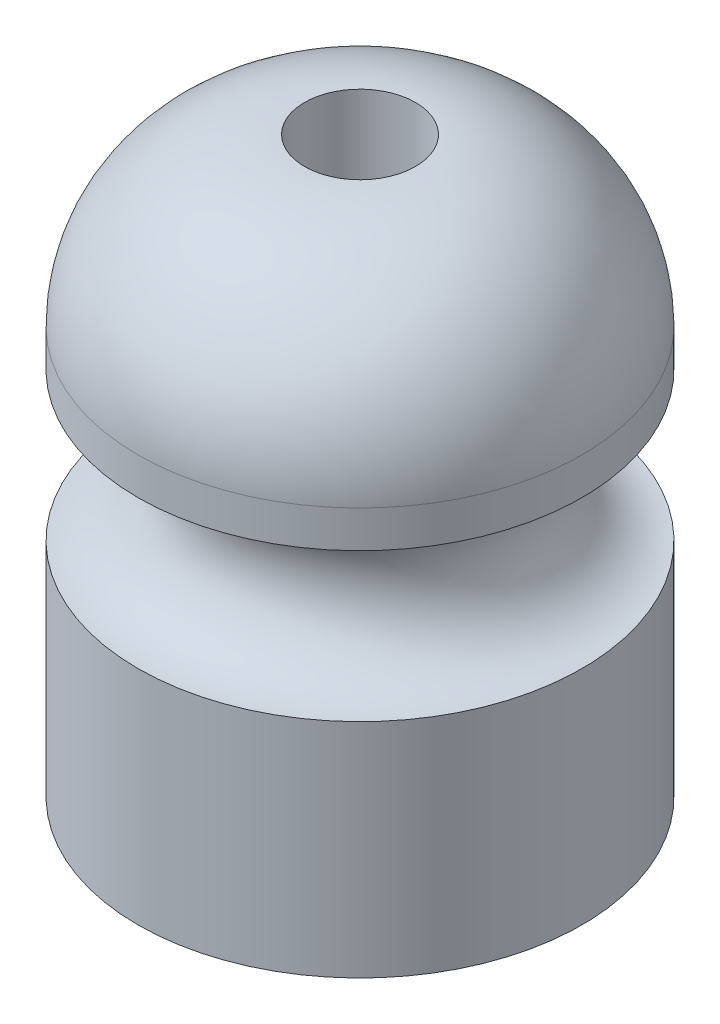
ISO-10303-21;
HEADER;
FILE_DESCRIPTION(('STEP AP214'),'2;1');
FILE_NAME('part.step','',(''),(''),'','','');
FILE_SCHEMA(('AUTOMOTIVE_DESIGN { 1 0 10303 214 1 1 1 1 }'));
ENDSEC;
DATA;
#1=APPLICATION_CONTEXT('core data for automotive mechanical design processes');
#2=APPLICATION_PROTOCOL_DEFINITION('international standard','automotive_design',2000,#1);
#3=PRODUCT_CONTEXT('',#1,'mechanical');
#4=PRODUCT('Part','Part','',(#3));
#5=PRODUCT_RELATED_PRODUCT_CATEGORY('part','',(#4));
#6=PRODUCT_DEFINITION_FORMATION('','',#4);
#7=PRODUCT_DEFINITION_CONTEXT('part definition',#1,'design');
#8=PRODUCT_DEFINITION('design','',#6,#7);
#9=PRODUCT_DEFINITION_SHAPE('','',#8);
#10=(LENGTH_UNIT() NAMED_UNIT(*) SI_UNIT(.MILLI.,.METRE.));
#11=(NAMED_UNIT(*) PLANE_ANGLE_UNIT() SI_UNIT($,.RADIAN.));
#12=(NAMED_UNIT(*) SI_UNIT($,.STERADIAN.) SOLID_ANGLE_UNIT());
#13=UNCERTAINTY_MEASURE_WITH_UNIT(LENGTH_MEASURE(1.E-05),#10,'distance_accuracy_value','');
#14=(GEOMETRIC_REPRESENTATION_CONTEXT(3) GLOBAL_UNCERTAINTY_ASSIGNED_CONTEXT((#13)) GLOBAL_UNIT_ASSIGNED_CONTEXT((#10,
#11,#12)) REPRESENTATION_CONTEXT('',''));
#15=CARTESIAN_POINT('',(0.,0.,0.));
#16=DIRECTION('',(0.,0.,1.));
#17=DIRECTION('',(1.,0.,0.));
#18=AXIS2_PLACEMENT_3D('',#15,#16,#17);
#19=CARTESIAN_POINT('',(0.,55.,0.));
#20=DIRECTION('',(0.,-1.,0.));
#21=DIRECTION('',(0.,0.,-1.));
#22=AXIS2_PLACEMENT_3D('',#19,#20,#21);
#23=DEGENERATE_TOROIDAL_SURFACE('',#22,7.5,22.5,.T.);
#24=CARTESIAN_POINT('',(0.,55.,0.));
#25=DIRECTION('',(0.,-1.,0.));
#26=DIRECTION('',(0.,0.,-1.));
#27=AXIS2_PLACEMENT_3D('',#24,#25,#26);
#28=CIRCLE('',#27,30.);
#29=CARTESIAN_POINT('',(0.,55.,-30.));
#30=VERTEX_POINT('',#29);
#31=EDGE_CURVE('E52',#30,#30,#28,.T.);
#32=ORIENTED_EDGE('',*,*,#31,.F.);
#33=EDGE_LOOP('',(#32));
#34=FACE_BOUND('',#33,.T.);
#35=CARTESIAN_POINT('',(0.,77.5,0.));
#36=DIRECTION('',(0.,-1.,0.));
#37=DIRECTION('',(0.,0.,-1.));
#38=AXIS2_PLACEMENT_3D('',#35,#36,#37);
#39=CIRCLE('',#38,7.5);
#40=CARTESIAN_POINT('',(0.,77.5,-7.5));
#41=VERTEX_POINT('',#40);
#42=EDGE_CURVE('E10',#41,#41,#39,.T.);
#43=ORIENTED_EDGE('',*,*,#42,.T.);
#44=EDGE_LOOP('',(#43));
#45=FACE_BOUND('',#44,.T.);
#46=ADVANCED_FACE('F24',(#34,#45),#23,.T.);
#47=CARTESIAN_POINT('',(0.,0.,0.));
#48=DIRECTION('',(0.,-1.,0.));
#49=DIRECTION('',(0.,0.,-1.));
#50=AXIS2_PLACEMENT_3D('',#47,#48,#49);
#51=CYLINDRICAL_SURFACE('',#50,7.5);
#52=ORIENTED_EDGE('',*,*,#42,.F.);
#53=EDGE_LOOP('',(#52));
#54=FACE_BOUND('',#53,.T.);
#55=CARTESIAN_POINT('',(0.,10.,0.));
#56=DIRECTION('',(0.,-1.,0.));
#57=DIRECTION('',(0.,0.,-1.));
#58=AXIS2_PLACEMENT_3D('',#55,#56,#57);
#59=CIRCLE('',#58,7.5);
#60=CARTESIAN_POINT('',(0.,10.,-7.5));
#61=VERTEX_POINT('',#60);
#62=EDGE_CURVE('E30',#61,#61,#59,.T.);
#63=ORIENTED_EDGE('',*,*,#62,.T.);
#64=EDGE_LOOP('',(#63));
#65=FACE_BOUND('',#64,.T.);
#66=ADVANCED_FACE('F59',(#54,#65),#51,.F.);
#67=CARTESIAN_POINT('',(-21.3256017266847,10.,0.));
#68=DIRECTION('',(0.,1.,0.));
#69=DIRECTION('',(0.,0.,1.));
#70=AXIS2_PLACEMENT_3D('',#67,#68,#69);
#71=PLANE('',#70);
#72=ORIENTED_EDGE('',*,*,#62,.F.);
#73=EDGE_LOOP('',(#72));
#74=FACE_BOUND('',#73,.T.);
#75=CARTESIAN_POINT('',(0.,10.,0.));
#76=DIRECTION('',(0.,-1.,0.));
#77=DIRECTION('',(0.,0.,-1.));
#78=AXIS2_PLACEMENT_3D('',#75,#76,#77);
#79=CIRCLE('',#78,21.3256017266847);
#80=CARTESIAN_POINT('',(0.,10.,-21.3256017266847));
#81=VERTEX_POINT('',#80);
#82=EDGE_CURVE('E34',#81,#81,#79,.T.);
#83=ORIENTED_EDGE('',*,*,#82,.T.);
#84=EDGE_LOOP('',(#83));
#85=FACE_BOUND('',#84,.T.);
#86=ADVANCED_FACE('F63',(#74,#85),#71,.F.);
#87=CARTESIAN_POINT('',(0.,0.,0.));
#88=DIRECTION('',(0.,-1.,0.));
#89=DIRECTION('',(0.,0.,-1.));
#90=AXIS2_PLACEMENT_3D('',#87,#88,#89);
#91=CONICAL_SURFACE('',#90,25.,0.352126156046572);
#92=ORIENTED_EDGE('',*,*,#82,.F.);
#93=EDGE_LOOP('',(#92));
#94=FACE_BOUND('',#93,.T.);
#95=CARTESIAN_POINT('',(0.,0.,0.));
#96=DIRECTION('',(0.,-1.,0.));
#97=DIRECTION('',(0.,0.,-1.));
#98=AXIS2_PLACEMENT_3D('',#95,#96,#97);
#99=CIRCLE('',#98,25.);
#100=CARTESIAN_POINT('',(0.,0.,-25.));
#101=VERTEX_POINT('',#100);
#102=EDGE_CURVE('E38',#101,#101,#99,.T.);
#103=ORIENTED_EDGE('',*,*,#102,.T.);
#104=EDGE_LOOP('',(#103));
#105=FACE_BOUND('',#104,.T.);
#106=ADVANCED_FACE('F68',(#94,#105),#91,.F.);
#107=CARTESIAN_POINT('',(-25.,0.,0.));
#108=DIRECTION('',(0.,1.,0.));
#109=DIRECTION('',(0.,0.,1.));
#110=AXIS2_PLACEMENT_3D('',#107,#108,#109);
#111=PLANE('',#110);
#112=ORIENTED_EDGE('',*,*,#102,.F.);
#113=EDGE_LOOP('',(#112));
#114=FACE_BOUND('',#113,.T.);
#115=CARTESIAN_POINT('',(0.,0.,0.));
#116=DIRECTION('',(0.,-1.,0.));
#117=DIRECTION('',(0.,0.,-1.));
#118=AXIS2_PLACEMENT_3D('',#115,#116,#117);
#119=CIRCLE('',#118,30.);
#120=CARTESIAN_POINT('',(0.,0.,-30.));
#121=VERTEX_POINT('',#120);
#122=EDGE_CURVE('E43',#121,#121,#119,.T.);
#123=ORIENTED_EDGE('',*,*,#122,.T.);
#124=EDGE_LOOP('',(#123));
#125=FACE_BOUND('',#124,.T.);
#126=ADVANCED_FACE('F74',(#114,#125),#111,.F.);
#127=CARTESIAN_POINT('',(0.,0.,0.));
#128=DIRECTION('',(0.,-1.,0.));
#129=DIRECTION('',(0.,0.,-1.));
#130=AXIS2_PLACEMENT_3D('',#127,#128,#129);
#131=CYLINDRICAL_SURFACE('',#130,30.);
#132=ORIENTED_EDGE('',*,*,#122,.F.);
#133=EDGE_LOOP('',(#132));
#134=FACE_BOUND('',#133,.T.);
#135=CARTESIAN_POINT('',(0.,30.,0.));
#136=DIRECTION('',(0.,-1.,0.));
#137=DIRECTION('',(0.,0.,-1.));
#138=AXIS2_PLACEMENT_3D('',#135,#136,#137);
#139=CIRCLE('',#138,30.);
#140=CARTESIAN_POINT('',(0.,30.,-30.));
#141=VERTEX_POINT('',#140);
#142=EDGE_CURVE('E46',#141,#141,#139,.T.);
#143=ORIENTED_EDGE('',*,*,#142,.T.);
#144=EDGE_LOOP('',(#143));
#145=FACE_BOUND('',#144,.T.);
#146=ADVANCED_FACE('F78',(#134,#145),#131,.T.);
#147=CARTESIAN_POINT('',(0.,40.,0.));
#148=DIRECTION('',(0.,-1.,0.));
#149=DIRECTION('',(0.,0.,-1.));
#150=AXIS2_PLACEMENT_3D('',#147,#148,#149);
#151=TOROIDAL_SURFACE('',#150,30.,10.);
#152=ORIENTED_EDGE('',*,*,#142,.F.);
#153=EDGE_LOOP('',(#152));
#154=FACE_BOUND('',#153,.T.);
#155=CARTESIAN_POINT('',(0.,50.,0.));
#156=DIRECTION('',(0.,-1.,0.));
#157=DIRECTION('',(0.,0.,-1.));
#158=AXIS2_PLACEMENT_3D('',#155,#156,#157);
#159=CIRCLE('',#158,30.);
#160=CARTESIAN_POINT('',(0.,50.,-30.));
#161=VERTEX_POINT('',#160);
#162=EDGE_CURVE('E49',#161,#161,#159,.T.);
#163=ORIENTED_EDGE('',*,*,#162,.T.);
#164=EDGE_LOOP('',(#163));
#165=FACE_BOUND('',#164,.T.);
#166=ADVANCED_FACE('F82',(#154,#165),#151,.F.);
#167=CARTESIAN_POINT('',(0.,0.,0.));
#168=DIRECTION('',(0.,-1.,0.));
#169=DIRECTION('',(0.,0.,-1.));
#170=AXIS2_PLACEMENT_3D('',#167,#168,#169);
#171=CYLINDRICAL_SURFACE('',#170,30.);
#172=ORIENTED_EDGE('',*,*,#162,.F.);
#173=EDGE_LOOP('',(#172));
#174=FACE_BOUND('',#173,.T.);
#175=ORIENTED_EDGE('',*,*,#31,.T.);
#176=EDGE_LOOP('',(#175));
#177=FACE_BOUND('',#176,.T.);
#178=ADVANCED_FACE('F56',(#174,#177),#171,.T.);
#179=CLOSED_SHELL('',(#46,#66,#86,#106,#126,#146,#166,#178));
#180=MANIFOLD_SOLID_BREP('B2',#179);
#181=ADVANCED_BREP_SHAPE_REPRESENTATION('',(#18,#180),#14);
#182=SHAPE_DEFINITION_REPRESENTATION(#9,#181);
ENDSEC;
END-ISO-10303-21;
